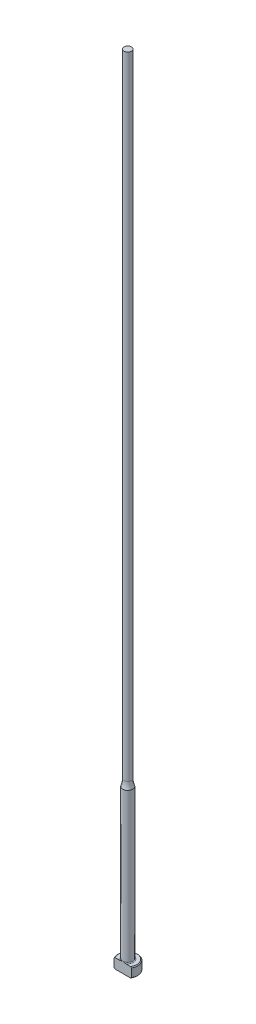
ISO-10303-21;
HEADER;
FILE_DESCRIPTION(('STEP AP214'),'2;1');
FILE_NAME('part.step','',(''),(''),'','','');
FILE_SCHEMA(('AUTOMOTIVE_DESIGN { 1 0 10303 214 1 1 1 1 }'));
ENDSEC;
DATA;
#1=APPLICATION_CONTEXT('core data for automotive mechanical design processes');
#2=APPLICATION_PROTOCOL_DEFINITION('international standard','automotive_design',2000,#1);
#3=PRODUCT_CONTEXT('',#1,'mechanical');
#4=PRODUCT('Part','Part','',(#3));
#5=PRODUCT_RELATED_PRODUCT_CATEGORY('part','',(#4));
#6=PRODUCT_DEFINITION_FORMATION('','',#4);
#7=PRODUCT_DEFINITION_CONTEXT('part definition',#1,'design');
#8=PRODUCT_DEFINITION('design','',#6,#7);
#9=PRODUCT_DEFINITION_SHAPE('','',#8);
#10=(LENGTH_UNIT() NAMED_UNIT(*) SI_UNIT(.MILLI.,.METRE.));
#11=(NAMED_UNIT(*) PLANE_ANGLE_UNIT() SI_UNIT($,.RADIAN.));
#12=(NAMED_UNIT(*) SI_UNIT($,.STERADIAN.) SOLID_ANGLE_UNIT());
#13=UNCERTAINTY_MEASURE_WITH_UNIT(LENGTH_MEASURE(1.E-05),#10,'distance_accuracy_value','');
#14=(GEOMETRIC_REPRESENTATION_CONTEXT(3) GLOBAL_UNCERTAINTY_ASSIGNED_CONTEXT((#13)) GLOBAL_UNIT_ASSIGNED_CONTEXT((#10,
#11,#12)) REPRESENTATION_CONTEXT('',''));
#15=CARTESIAN_POINT('',(0.,0.,0.));
#16=DIRECTION('',(0.,0.,1.));
#17=DIRECTION('',(1.,0.,0.));
#18=AXIS2_PLACEMENT_3D('',#15,#16,#17);
#19=CARTESIAN_POINT('',(-1.18998999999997,254.,0.));
#20=DIRECTION('',(0.,1.,0.));
#21=DIRECTION('',(0.,0.,1.));
#22=AXIS2_PLACEMENT_3D('',#19,#20,#21);
#23=PLANE('',#22);
#24=CARTESIAN_POINT('',(0.,254.,0.));
#25=DIRECTION('',(0.,1.,0.));
#26=DIRECTION('',(0.,0.,1.));
#27=AXIS2_PLACEMENT_3D('',#24,#25,#26);
#28=CIRCLE('',#27,1.18998999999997);
#29=CARTESIAN_POINT('',(0.,254.,1.18998999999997));
#30=VERTEX_POINT('',#29);
#31=EDGE_CURVE('E169',#30,#30,#28,.T.);
#32=ORIENTED_EDGE('',*,*,#31,.T.);
#33=EDGE_LOOP('',(#32));
#34=FACE_BOUND('',#33,.T.);
#35=ADVANCED_FACE('F37',(#34),#23,.T.);
#36=CARTESIAN_POINT('',(0.,259.958771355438,0.));
#37=DIRECTION('',(0.,1.,0.));
#38=DIRECTION('',(0.,0.,1.));
#39=AXIS2_PLACEMENT_3D('',#36,#37,#38);
#40=CYLINDRICAL_SURFACE('',#39,1.18998999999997);
#41=CARTESIAN_POINT('',(0.,53.0114164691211,0.));
#42=DIRECTION('',(0.,1.,0.));
#43=DIRECTION('',(0.,0.,1.));
#44=AXIS2_PLACEMENT_3D('',#41,#42,#43);
#45=CIRCLE('',#44,1.18998999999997);
#46=CARTESIAN_POINT('',(0.,53.0114164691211,1.18998999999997));
#47=VERTEX_POINT('',#46);
#48=EDGE_CURVE('E172',#47,#47,#45,.T.);
#49=ORIENTED_EDGE('',*,*,#48,.T.);
#50=EDGE_LOOP('',(#49));
#51=FACE_BOUND('',#50,.T.);
#52=ORIENTED_EDGE('',*,*,#31,.F.);
#53=EDGE_LOOP('',(#52));
#54=FACE_BOUND('',#53,.T.);
#55=ADVANCED_FACE('F160',(#51,#54),#40,.T.);
#56=CARTESIAN_POINT('',(0.,53.0114164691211,0.));
#57=DIRECTION('',(0.,1.,0.));
#58=DIRECTION('',(0.,0.,1.));
#59=AXIS2_PLACEMENT_3D('',#56,#57,#58);
#60=TOROIDAL_SURFACE('',#59,7.53998999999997,6.35);
#61=CARTESIAN_POINT('',(0.,50.8,0.));
#62=DIRECTION('',(0.,1.,0.));
#63=DIRECTION('',(0.,0.,1.));
#64=AXIS2_PLACEMENT_3D('',#61,#62,#63);
#65=CIRCLE('',#64,1.58749999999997);
#66=CARTESIAN_POINT('',(0.,50.8,1.58749999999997));
#67=VERTEX_POINT('',#66);
#68=EDGE_CURVE('E100',#67,#67,#65,.T.);
#69=ORIENTED_EDGE('',*,*,#68,.T.);
#70=EDGE_LOOP('',(#69));
#71=FACE_BOUND('',#70,.T.);
#72=ORIENTED_EDGE('',*,*,#48,.F.);
#73=EDGE_LOOP('',(#72));
#74=FACE_BOUND('',#73,.T.);
#75=ADVANCED_FACE('F165',(#71,#74),#60,.F.);
#76=CARTESIAN_POINT('',(0.,259.958771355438,0.));
#77=DIRECTION('',(0.,1.,0.));
#78=DIRECTION('',(0.,0.,1.));
#79=AXIS2_PLACEMENT_3D('',#76,#77,#78);
#80=CYLINDRICAL_SURFACE('',#79,1.58749999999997);
#81=CARTESIAN_POINT('',(0.,3.42900000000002,0.));
#82=DIRECTION('',(0.,1.,0.));
#83=DIRECTION('',(0.,0.,1.));
#84=AXIS2_PLACEMENT_3D('',#81,#82,#83);
#85=CIRCLE('',#84,1.58749999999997);
#86=CARTESIAN_POINT('',(0.,3.42900000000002,1.58749999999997));
#87=VERTEX_POINT('',#86);
#88=EDGE_CURVE('E109',#87,#87,#85,.T.);
#89=ORIENTED_EDGE('',*,*,#88,.T.);
#90=EDGE_LOOP('',(#89));
#91=FACE_BOUND('',#90,.T.);
#92=ORIENTED_EDGE('',*,*,#68,.F.);
#93=EDGE_LOOP('',(#92));
#94=FACE_BOUND('',#93,.T.);
#95=ADVANCED_FACE('F192',(#91,#94),#80,.T.);
#96=CARTESIAN_POINT('',(-3.17499999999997,3.175,0.));
#97=DIRECTION('',(0.,1.,0.));
#98=DIRECTION('',(0.,0.,1.));
#99=AXIS2_PLACEMENT_3D('',#96,#97,#98);
#100=PLANE('',#99);
#101=DIRECTION('',(-1.,0.,0.));
#102=VECTOR('',#101,1.);
#103=CARTESIAN_POINT('',(-3.17499999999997,3.175,1.58749999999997));
#104=LINE('',#103,#102);
#105=CARTESIAN_POINT('',(2.45195529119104,3.175,1.58749999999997));
#106=VERTEX_POINT('',#105);
#107=CARTESIAN_POINT('',(0.933255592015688,3.175,1.58749999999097));
#108=VERTEX_POINT('',#107);
#109=EDGE_CURVE('E58',#106,#108,#104,.T.);
#110=ORIENTED_EDGE('',*,*,#109,.F.);
#111=CARTESIAN_POINT('',(0.,3.175,0.));
#112=DIRECTION('',(0.,1.,0.));
#113=DIRECTION('',(0.,0.,1.));
#114=AXIS2_PLACEMENT_3D('',#111,#112,#113);
#115=CIRCLE('',#114,2.92099999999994);
#116=CARTESIAN_POINT('',(-2.45195529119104,3.175,1.58749999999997));
#117=VERTEX_POINT('',#116);
#118=EDGE_CURVE('E171',#106,#117,#115,.T.);
#119=ORIENTED_EDGE('',*,*,#118,.T.);
#120=CARTESIAN_POINT('',(-0.933255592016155,3.17500000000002,1.58749999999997));
#121=VERTEX_POINT('',#120);
#122=EDGE_CURVE('E140',#121,#117,#104,.T.);
#123=ORIENTED_EDGE('',*,*,#122,.F.);
#124=CARTESIAN_POINT('',(0.,3.175,0.));
#125=DIRECTION('',(0.,1.,0.));
#126=DIRECTION('',(0.,0.,1.));
#127=AXIS2_PLACEMENT_3D('',#124,#125,#126);
#128=CIRCLE('',#127,1.84149999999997);
#129=EDGE_CURVE('E113',#121,#108,#128,.F.);
#130=ORIENTED_EDGE('',*,*,#129,.T.);
#131=EDGE_LOOP('',(#110,#119,#123,#130));
#132=FACE_BOUND('',#131,.T.);
#133=ADVANCED_FACE('F189',(#132),#100,.T.);
#134=CARTESIAN_POINT('',(0.,259.958771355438,0.));
#135=DIRECTION('',(0.,1.,0.));
#136=DIRECTION('',(0.,0.,1.));
#137=AXIS2_PLACEMENT_3D('',#134,#135,#136);
#138=CYLINDRICAL_SURFACE('',#137,3.17499999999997);
#139=DIRECTION('',(0.,-1.,0.));
#140=VECTOR('',#139,1.);
#141=CARTESIAN_POINT('',(-2.74963065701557,254.,1.58749999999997));
#142=LINE('',#141,#140);
#143=CARTESIAN_POINT('',(-2.74963065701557,2.92100000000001,1.58749999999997));
#144=VERTEX_POINT('',#143);
#145=CARTESIAN_POINT('',(-2.74963065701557,0.253999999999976,1.58749999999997));
#146=VERTEX_POINT('',#145);
#147=EDGE_CURVE('E95',#144,#146,#142,.T.);
#148=ORIENTED_EDGE('',*,*,#147,.F.);
#149=CARTESIAN_POINT('',(0.,2.92100000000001,0.));
#150=DIRECTION('',(0.,1.,0.));
#151=DIRECTION('',(0.,0.,1.));
#152=AXIS2_PLACEMENT_3D('',#149,#150,#151);
#153=CIRCLE('',#152,3.17499999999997);
#154=CARTESIAN_POINT('',(2.74963065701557,2.92100000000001,1.58749999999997));
#155=VERTEX_POINT('',#154);
#156=EDGE_CURVE('E110',#144,#155,#153,.F.);
#157=ORIENTED_EDGE('',*,*,#156,.T.);
#158=DIRECTION('',(0.,-1.,0.));
#159=VECTOR('',#158,1.);
#160=CARTESIAN_POINT('',(2.74963065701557,254.,1.58749999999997));
#161=LINE('',#160,#159);
#162=CARTESIAN_POINT('',(2.74963065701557,0.253999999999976,1.58749999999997));
#163=VERTEX_POINT('',#162);
#164=EDGE_CURVE('E182',#155,#163,#161,.T.);
#165=ORIENTED_EDGE('',*,*,#164,.T.);
#166=CARTESIAN_POINT('',(0.,0.253999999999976,0.));
#167=DIRECTION('',(0.,-1.,0.));
#168=DIRECTION('',(0.,0.,-1.));
#169=AXIS2_PLACEMENT_3D('',#166,#167,#168);
#170=CIRCLE('',#169,3.17499999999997);
#171=EDGE_CURVE('E116',#163,#146,#170,.F.);
#172=ORIENTED_EDGE('',*,*,#171,.T.);
#173=EDGE_LOOP('',(#148,#157,#165,#172));
#174=FACE_BOUND('',#173,.T.);
#175=ADVANCED_FACE('F180',(#174),#138,.T.);
#176=CARTESIAN_POINT('',(0.,0.,0.));
#177=DIRECTION('',(0.,-1.,0.));
#178=DIRECTION('',(0.,0.,-1.));
#179=AXIS2_PLACEMENT_3D('',#176,#177,#178);
#180=PLANE('',#179);
#181=DIRECTION('',(1.,0.,0.));
#182=VECTOR('',#181,1.);
#183=CARTESIAN_POINT('',(-2.74963065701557,0.,1.58749999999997));
#184=LINE('',#183,#182);
#185=CARTESIAN_POINT('',(-2.45195529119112,0.,1.58749999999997));
#186=VERTEX_POINT('',#185);
#187=CARTESIAN_POINT('',(2.45195529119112,0.,1.58749999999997));
#188=VERTEX_POINT('',#187);
#189=EDGE_CURVE('E92',#186,#188,#184,.T.);
#190=ORIENTED_EDGE('',*,*,#189,.F.);
#191=CARTESIAN_POINT('',(0.,0.,0.));
#192=DIRECTION('',(0.,-1.,0.));
#193=DIRECTION('',(0.,0.,-1.));
#194=AXIS2_PLACEMENT_3D('',#191,#192,#193);
#195=CIRCLE('',#194,2.92100000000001);
#196=EDGE_CURVE('E106',#186,#188,#195,.T.);
#197=ORIENTED_EDGE('',*,*,#196,.T.);
#198=EDGE_LOOP('',(#190,#197));
#199=FACE_BOUND('',#198,.T.);
#200=ADVANCED_FACE('F105',(#199),#180,.T.);
#201=CARTESIAN_POINT('',(0.,3.17499999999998,0.));
#202=DIRECTION('',(0.,-1.,0.));
#203=DIRECTION('',(0.,0.,-1.));
#204=AXIS2_PLACEMENT_3D('',#201,#202,#203);
#205=CONICAL_SURFACE('',#204,2.92099999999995,0.785398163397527);
#206=CARTESIAN_POINT('',(2.75033065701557,2.9203937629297,1.58749999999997));
#207=CARTESIAN_POINT('',(2.66887796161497,2.99091042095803,1.58749999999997));
#208=CARTESIAN_POINT('',(2.58705989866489,3.0610138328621,1.58749999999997));
#209=CARTESIAN_POINT('',(2.42241022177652,3.20009957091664,1.58749999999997));
#210=CARTESIAN_POINT('',(2.33957813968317,3.26908134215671,1.58749999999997));
#211=CARTESIAN_POINT('',(2.17073968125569,3.40716024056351,1.58749999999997));
#212=CARTESIAN_POINT('',(2.08470440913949,3.47622217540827,1.58749999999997));
#213=CARTESIAN_POINT('',(1.91099881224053,3.61222325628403,1.58749999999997));
#214=CARTESIAN_POINT('',(1.82332890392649,3.67916293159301,1.58749999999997));
#215=CARTESIAN_POINT('',(1.64569223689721,3.8102066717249,1.58749999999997));
#216=CARTESIAN_POINT('',(1.55572245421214,3.8743066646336,1.58749999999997));
#217=CARTESIAN_POINT('',(1.37280394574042,3.99833089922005,1.58749999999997));
#218=CARTESIAN_POINT('',(1.27985285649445,4.05825170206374,1.58749999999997));
#219=CARTESIAN_POINT('',(1.09086561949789,4.17130826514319,1.58749999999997));
#220=CARTESIAN_POINT('',(0.994859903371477,4.22449421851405,1.58749999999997));
#221=CARTESIAN_POINT('',(0.798114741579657,4.32122233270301,1.58749999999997));
#222=CARTESIAN_POINT('',(0.697384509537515,4.36478238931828,1.58749999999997));
#223=CARTESIAN_POINT('',(0.541185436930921,4.41951656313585,1.58749999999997));
#224=CARTESIAN_POINT('',(0.487627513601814,4.43611950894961,1.58749999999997));
#225=CARTESIAN_POINT('',(0.379267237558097,4.46466012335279,1.58749999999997));
#226=CARTESIAN_POINT('',(0.324465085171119,4.4765985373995,1.58749999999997));
#227=CARTESIAN_POINT('',(0.214272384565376,4.49501904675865,1.58749999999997));
#228=CARTESIAN_POINT('',(0.158887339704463,4.50153345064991,1.58749999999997));
#229=CARTESIAN_POINT('',(0.047736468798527,4.5087502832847,1.58749999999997));
#230=CARTESIAN_POINT('',(-0.00802931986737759,4.50945327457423,1.58749999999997));
#231=CARTESIAN_POINT('',(-0.119372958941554,4.50499163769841,1.58749999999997));
#232=CARTESIAN_POINT('',(-0.174950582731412,4.49982147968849,1.58749999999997));
#233=CARTESIAN_POINT('',(-0.285312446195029,4.48399101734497,1.58749999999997));
#234=CARTESIAN_POINT('',(-0.340096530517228,4.4733296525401,1.58749999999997));
#235=CARTESIAN_POINT('',(-0.448865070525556,4.44711334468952,1.58749999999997));
#236=CARTESIAN_POINT('',(-0.502841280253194,4.43152477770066,1.58749999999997));
#237=CARTESIAN_POINT('',(-0.609429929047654,4.39628553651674,1.58749999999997));
#238=CARTESIAN_POINT('',(-0.662042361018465,4.37663484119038,1.58749999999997));
#239=CARTESIAN_POINT('',(-0.778129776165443,4.32902110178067,1.58749999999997));
#240=CARTESIAN_POINT('',(-0.841245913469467,4.30019026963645,1.58749999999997));
#241=CARTESIAN_POINT('',(-0.96559457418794,4.23868811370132,1.58749999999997));
#242=CARTESIAN_POINT('',(-1.02682597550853,4.20601455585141,1.58749999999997));
#243=CARTESIAN_POINT('',(-1.14774341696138,4.13769010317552,1.58749999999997));
#244=CARTESIAN_POINT('',(-1.20742632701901,4.10203371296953,1.58749999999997));
#245=CARTESIAN_POINT('',(-1.32539130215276,4.02846531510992,1.58749999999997));
#246=CARTESIAN_POINT('',(-1.38367308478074,3.99055285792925,1.58749999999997));
#247=CARTESIAN_POINT('',(-1.55734442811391,3.87382704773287,1.58749999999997));
#248=CARTESIAN_POINT('',(-1.6709584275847,3.79237897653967,1.58749999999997));
#249=CARTESIAN_POINT('',(-1.89475235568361,3.62521862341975,1.58749999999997));
#250=CARTESIAN_POINT('',(-2.00493591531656,3.53951111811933,1.58749999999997));
#251=CARTESIAN_POINT('',(-2.22248693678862,3.36554942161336,1.58749999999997));
#252=CARTESIAN_POINT('',(-2.32986450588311,3.27730782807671,1.58749999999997));
#253=CARTESIAN_POINT('',(-2.48909538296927,3.14389342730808,1.58749999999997));
#254=CARTESIAN_POINT('',(-2.54159338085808,3.09948435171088,1.58749999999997));
#255=CARTESIAN_POINT('',(-2.64622282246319,3.01024124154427,1.58749999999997));
#256=CARTESIAN_POINT('',(-2.69835428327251,2.96540722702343,1.58749999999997));
#257=CARTESIAN_POINT('',(-2.75033065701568,2.92039376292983,1.58749999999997));
#258=B_SPLINE_CURVE_WITH_KNOTS('',3,(#206,#207,#208,#209,#210,#211,#212,#213,#214,#215,#216,
#217,#218,#219,#220,#221,#222,#223,#224,#225,#226,#227,#228,#229,#230,#231,#232,#233,#234,#235,
#236,#237,#238,#239,#240,#241,#242,#243,#244,#245,#246,#247,#248,#249,#250,#251,#252,#253,#254,
#255,#256,#257),.UNSPECIFIED.,.F.,.F.,(4,2,2,2,2,2,2,2,2,2,2,2,2,2,2,2,2,2,2,2,2,2,2,2,2,4),(0.,
0.323216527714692,0.64658837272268,0.97753957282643,1.30840757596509,1.639735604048,
1.97133312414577,2.30029221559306,2.62863448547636,2.79668277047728,2.96470418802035,
3.13171746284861,3.29871457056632,3.46586904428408,3.63305581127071,3.80140905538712,
3.96976317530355,4.17775353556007,4.38586541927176,4.59436953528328,4.80291533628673,
5.22209642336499,5.64081759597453,6.0577303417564,6.26401477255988,6.47028951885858),.UNSPECIFIED.);
#259=EDGE_CURVE('E63',#155,#106,#258,.T.);
#260=ORIENTED_EDGE('',*,*,#259,.F.);
#261=ORIENTED_EDGE('',*,*,#156,.F.);
#262=EDGE_CURVE('E133',#117,#144,#258,.T.);
#263=ORIENTED_EDGE('',*,*,#262,.F.);
#264=ORIENTED_EDGE('',*,*,#118,.F.);
#265=EDGE_LOOP('',(#260,#261,#263,#264));
#266=FACE_BOUND('',#265,.T.);
#267=ADVANCED_FACE('F147',(#266),#205,.T.);
#268=CARTESIAN_POINT('',(0.,0.253999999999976,0.));
#269=DIRECTION('',(0.,1.,0.));
#270=DIRECTION('',(0.,0.,1.));
#271=AXIS2_PLACEMENT_3D('',#268,#269,#270);
#272=CONICAL_SURFACE('',#271,3.17499999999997,0.785398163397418);
#273=CARTESIAN_POINT('',(-2.75033065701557,0.254606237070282,1.58749999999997));
#274=CARTESIAN_POINT('',(-2.66887796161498,0.184089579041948,1.58749999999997));
#275=CARTESIAN_POINT('',(-2.58705989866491,0.113986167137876,1.58749999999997));
#276=CARTESIAN_POINT('',(-2.42241022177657,-0.0250995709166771,1.58749999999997));
#277=CARTESIAN_POINT('',(-2.33957813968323,-0.0940813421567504,1.58749999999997));
#278=CARTESIAN_POINT('',(-2.17073968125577,-0.232160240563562,1.58749999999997));
#279=CARTESIAN_POINT('',(-2.08470440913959,-0.301222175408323,1.58749999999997));
#280=CARTESIAN_POINT('',(-1.91099881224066,-0.437223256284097,1.58749999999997));
#281=CARTESIAN_POINT('',(-1.82332890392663,-0.50416293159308,1.58749999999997));
#282=CARTESIAN_POINT('',(-1.64569223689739,-0.635206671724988,1.58749999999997));
#283=CARTESIAN_POINT('',(-1.55572245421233,-0.699306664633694,1.58749999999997));
#284=CARTESIAN_POINT('',(-1.37280394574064,-0.823330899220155,1.58749999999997));
#285=CARTESIAN_POINT('',(-1.27985285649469,-0.883251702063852,1.58749999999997));
#286=CARTESIAN_POINT('',(-1.09086561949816,-0.996308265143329,1.58749999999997));
#287=CARTESIAN_POINT('',(-0.994859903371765,-1.0494942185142,1.58749999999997));
#288=CARTESIAN_POINT('',(-0.798114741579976,-1.14622233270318,1.58749999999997));
#289=CARTESIAN_POINT('',(-0.697384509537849,-1.18978238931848,1.58749999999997));
#290=CARTESIAN_POINT('',(-0.54118543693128,-1.24451656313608,1.58749999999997));
#291=CARTESIAN_POINT('',(-0.487627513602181,-1.26111950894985,1.58749999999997));
#292=CARTESIAN_POINT('',(-0.379267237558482,-1.28966012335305,1.58749999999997));
#293=CARTESIAN_POINT('',(-0.324465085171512,-1.30159853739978,1.58749999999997));
#294=CARTESIAN_POINT('',(-0.214272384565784,-1.32001904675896,1.58749999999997));
#295=CARTESIAN_POINT('',(-0.158887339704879,-1.32653345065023,1.58749999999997));
#296=CARTESIAN_POINT('',(-0.0477364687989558,-1.33375028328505,1.58749999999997));
#297=CARTESIAN_POINT('',(0.00802931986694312,-1.33445327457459,1.58749999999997));
#298=CARTESIAN_POINT('',(0.119372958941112,-1.32999163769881,1.58749999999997));
#299=CARTESIAN_POINT('',(0.174950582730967,-1.3248214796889,1.58749999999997));
#300=CARTESIAN_POINT('',(0.28531244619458,-1.30899101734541,1.58749999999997));
#301=CARTESIAN_POINT('',(0.340096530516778,-1.29832965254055,1.58749999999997));
#302=CARTESIAN_POINT('',(0.448865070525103,-1.27211334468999,1.58749999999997));
#303=CARTESIAN_POINT('',(0.50284128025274,-1.25652477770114,1.58749999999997));
#304=CARTESIAN_POINT('',(0.609429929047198,-1.22128553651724,1.58749999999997));
#305=CARTESIAN_POINT('',(0.662042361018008,-1.20163484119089,1.58749999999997));
#306=CARTESIAN_POINT('',(0.778129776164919,-1.15402110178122,1.58749999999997));
#307=CARTESIAN_POINT('',(0.841245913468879,-1.12519026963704,1.58749999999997));
#308=CARTESIAN_POINT('',(0.965594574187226,-1.06368811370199,1.58749999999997));
#309=CARTESIAN_POINT('',(1.02682597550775,-1.03101455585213,1.58749999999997));
#310=CARTESIAN_POINT('',(1.14774341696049,-0.962690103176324,1.58749999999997));
#311=CARTESIAN_POINT('',(1.20742632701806,-0.927033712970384,1.58749999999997));
#312=CARTESIAN_POINT('',(1.32539130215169,-0.85346531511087,1.58749999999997));
#313=CARTESIAN_POINT('',(1.38367308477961,-0.815552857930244,1.58749999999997));
#314=CARTESIAN_POINT('',(1.5573444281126,-0.698827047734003,1.58749999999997));
#315=CARTESIAN_POINT('',(1.67095842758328,-0.617378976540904,1.58749999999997));
#316=CARTESIAN_POINT('',(1.89475235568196,-0.45021862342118,1.58749999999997));
#317=CARTESIAN_POINT('',(2.0049359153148,-0.364511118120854,1.58749999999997));
#318=CARTESIAN_POINT('',(2.22248693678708,-0.19054942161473,1.58749999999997));
#319=CARTESIAN_POINT('',(2.3298645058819,-0.102307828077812,1.58749999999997));
#320=CARTESIAN_POINT('',(2.48909538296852,0.0311065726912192,1.58749999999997));
#321=CARTESIAN_POINT('',(2.54159338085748,0.0755156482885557,1.58749999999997));
#322=CARTESIAN_POINT('',(2.64622282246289,0.16475875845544,1.58749999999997));
#323=CARTESIAN_POINT('',(2.69835428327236,0.209592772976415,1.58749999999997));
#324=CARTESIAN_POINT('',(2.75033065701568,0.254606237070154,1.58749999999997));
#325=B_SPLINE_CURVE_WITH_KNOTS('',3,(#273,#274,#275,#276,#277,#278,#279,#280,#281,#282,#283,
#284,#285,#286,#287,#288,#289,#290,#291,#292,#293,#294,#295,#296,#297,#298,#299,#300,#301,#302,
#303,#304,#305,#306,#307,#308,#309,#310,#311,#312,#313,#314,#315,#316,#317,#318,#319,#320,#321,
#322,#323,#324),.UNSPECIFIED.,.F.,.F.,(4,2,2,2,2,2,2,2,2,2,2,2,2,2,2,2,2,2,2,2,2,2,2,2,2,4),(0.,
0.323216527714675,0.646588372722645,0.977539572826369,1.308407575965,1.63973560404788,
1.97133312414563,2.3002922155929,2.62863448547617,2.79668277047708,2.96470418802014,
3.13171746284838,3.29871457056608,3.46586904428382,3.63305581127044,3.80140905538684,
3.96976317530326,4.17775353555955,4.38586541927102,4.59436953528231,4.80291533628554,
5.22209642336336,5.64081759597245,6.05773034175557,6.26401477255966,6.47028951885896),.UNSPECIFIED.);
#326=EDGE_CURVE('E89',#146,#186,#325,.T.);
#327=ORIENTED_EDGE('',*,*,#326,.F.);
#328=ORIENTED_EDGE('',*,*,#171,.F.);
#329=EDGE_CURVE('E101',#188,#163,#325,.T.);
#330=ORIENTED_EDGE('',*,*,#329,.F.);
#331=ORIENTED_EDGE('',*,*,#196,.F.);
#332=EDGE_LOOP('',(#327,#328,#330,#331));
#333=FACE_BOUND('',#332,.T.);
#334=ADVANCED_FACE('F108',(#333),#272,.T.);
#335=CARTESIAN_POINT('',(0.,3.42900000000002,0.));
#336=DIRECTION('',(0.,1.,0.));
#337=DIRECTION('',(0.,0.,1.));
#338=AXIS2_PLACEMENT_3D('',#335,#336,#337);
#339=TOROIDAL_SURFACE('',#338,1.84149999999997,0.254);
#340=ORIENTED_EDGE('',*,*,#129,.F.);
#341=CARTESIAN_POINT('',(0.,3.42900000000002,1.58749999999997));
#342=CARTESIAN_POINT('',(-1.92205025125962E-10,3.42900057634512,1.58749999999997));
#343=CARTESIAN_POINT('',(-1.22611614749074E-07,3.42900115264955,1.58749999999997));
#344=CARTESIAN_POINT('',(-5.0967636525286E-07,3.42900226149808,1.58749999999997));
#345=CARTESIAN_POINT('',(-7.78176328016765E-07,3.42900279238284,1.58749999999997));
#346=CARTESIAN_POINT('',(-1.42307272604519E-06,3.42900385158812,1.58749999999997));
#347=CARTESIAN_POINT('',(-1.80713867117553E-06,3.42900437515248,1.58749999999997));
#348=CARTESIAN_POINT('',(-2.63494846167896E-06,3.4290053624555,1.58749999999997));
#349=CARTESIAN_POINT('',(-3.07814756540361E-06,3.42900582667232,1.58749999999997));
#350=CARTESIAN_POINT('',(-4.66897357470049E-06,3.4290073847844,1.58749999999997));
#351=CARTESIAN_POINT('',(-5.89404908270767E-06,3.42900840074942,1.58749999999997));
#352=CARTESIAN_POINT('',(-8.42427511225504E-06,3.42901020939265,1.58749999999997));
#353=CARTESIAN_POINT('',(-9.72480574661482E-06,3.42901100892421,1.58749999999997));
#354=CARTESIAN_POINT('',(-1.48060601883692E-05,3.42901401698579,1.58749999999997));
#355=CARTESIAN_POINT('',(-1.86838281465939E-05,3.42901606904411,1.58749999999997));
#356=CARTESIAN_POINT('',(-2.63261117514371E-05,3.42901942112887,1.58749999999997));
#357=CARTESIAN_POINT('',(-3.00687417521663E-05,3.42902077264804,1.58749999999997));
#358=CARTESIAN_POINT('',(-4.60276298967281E-05,3.42902652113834,1.58749999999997));
#359=CARTESIAN_POINT('',(-5.8247019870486E-05,3.4290308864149,1.58749999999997));
#360=CARTESIAN_POINT('',(-8.11070097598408E-05,3.42903788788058,1.58749999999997));
#361=CARTESIAN_POINT('',(-9.16953114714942E-05,3.42904068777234,1.58749999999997));
#362=CARTESIAN_POINT('',(-0.000168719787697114,3.4290628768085,1.58749999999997));
#363=CARTESIAN_POINT('',(-0.00023219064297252,3.42909118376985,1.58749999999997));
#364=CARTESIAN_POINT('',(-0.000479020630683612,3.42919723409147,1.58749999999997));
#365=CARTESIAN_POINT('',(-0.000664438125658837,3.42926834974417,1.58749999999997));
#366=CARTESIAN_POINT('',(-0.00138448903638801,3.42954862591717,1.58749999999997));
#367=CARTESIAN_POINT('',(-0.00191701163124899,3.42976473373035,1.58749999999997));
#368=CARTESIAN_POINT('',(-0.00409774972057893,3.43064550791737,1.58749999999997));
#369=CARTESIAN_POINT('',(-0.00574830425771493,3.43130231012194,1.58749999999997));
#370=CARTESIAN_POINT('',(-0.0289985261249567,3.44055947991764,1.58749999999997));
#371=CARTESIAN_POINT('',(-0.0505816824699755,3.44921674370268,1.58749999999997));
#372=CARTESIAN_POINT('',(-0.0929947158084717,3.46610702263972,1.58749999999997));
#373=CARTESIAN_POINT('',(-0.11382315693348,3.47434394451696,1.58749999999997));
#374=CARTESIAN_POINT('',(-0.1579563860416,3.49164606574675,1.58749999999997));
#375=CARTESIAN_POINT('',(-0.181267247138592,3.5006960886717,1.58749999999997));
#376=CARTESIAN_POINT('',(-0.228222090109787,3.51863224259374,1.58749999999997));
#377=CARTESIAN_POINT('',(-0.251867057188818,3.52751579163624,1.58749999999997));
#378=CARTESIAN_POINT('',(-0.310512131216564,3.54905503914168,1.58749999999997));
#379=CARTESIAN_POINT('',(-0.345588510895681,3.56150550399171,1.58749999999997));
#380=CARTESIAN_POINT('',(-0.415278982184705,3.5850302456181,1.58749999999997));
#381=CARTESIAN_POINT('',(-0.449884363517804,3.59613012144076,1.58749999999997));
#382=CARTESIAN_POINT('',(-0.524471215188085,3.61841679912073,1.58749999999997));
#383=CARTESIAN_POINT('',(-0.564517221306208,3.62939137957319,1.58749999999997));
#384=CARTESIAN_POINT('',(-0.645529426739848,3.6489746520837,1.58749999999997));
#385=CARTESIAN_POINT('',(-0.686500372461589,3.65756417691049,1.58749999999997));
#386=CARTESIAN_POINT('',(-0.771546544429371,3.67188287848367,1.58749999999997));
#387=CARTESIAN_POINT('',(-0.815658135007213,3.67740449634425,1.58749999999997));
#388=CARTESIAN_POINT('',(-0.904117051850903,3.68344603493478,1.58749999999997));
#389=CARTESIAN_POINT('',(-0.948462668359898,3.68398638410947,1.58749999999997));
#390=CARTESIAN_POINT('',(-1.02531896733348,3.67901051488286,1.58749999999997));
#391=CARTESIAN_POINT('',(-1.05792141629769,3.67502604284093,1.58749999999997));
#392=CARTESIAN_POINT('',(-1.12184393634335,3.66230832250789,1.58749999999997));
#393=CARTESIAN_POINT('',(-1.1531753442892,3.65363950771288,1.58749999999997));
#394=CARTESIAN_POINT('',(-1.19946468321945,3.6356384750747,1.58749999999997));
#395=CARTESIAN_POINT('',(-1.21526783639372,3.62848492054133,1.58749999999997));
#396=CARTESIAN_POINT('',(-1.24583726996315,3.61212937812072,1.58749999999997));
#397=CARTESIAN_POINT('',(-1.26060215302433,3.60292469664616,1.58749999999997));
#398=CARTESIAN_POINT('',(-1.28575815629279,3.58421518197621,1.58749999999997));
#399=CARTESIAN_POINT('',(-1.29644383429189,3.57510998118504,1.58749999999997));
#400=CARTESIAN_POINT('',(-1.31623154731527,3.55531539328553,1.58749999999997));
#401=CARTESIAN_POINT('',(-1.32533681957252,3.54462932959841,1.58749999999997));
#402=CARTESIAN_POINT('',(-1.33941140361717,3.52450022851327,1.58749999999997));
#403=CARTESIAN_POINT('',(-1.34484814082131,3.51538553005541,1.58749999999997));
#404=CARTESIAN_POINT('',(-1.35416329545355,3.49638544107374,1.58749999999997));
#405=CARTESIAN_POINT('',(-1.35804267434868,3.48650053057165,1.58749999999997));
#406=CARTESIAN_POINT('',(-1.36398436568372,3.46611321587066,1.58749999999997));
#407=CARTESIAN_POINT('',(-1.36603350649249,3.45560690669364,1.58749999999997));
#408=CARTESIAN_POINT('',(-1.3680840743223,3.43439627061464,1.58749999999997));
#409=CARTESIAN_POINT('',(-1.36808648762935,3.42369204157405,1.58749999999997));
#410=CARTESIAN_POINT('',(-1.36616208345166,3.40366716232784,1.58749999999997));
#411=CARTESIAN_POINT('',(-1.36444960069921,3.39432493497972,1.58749999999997));
#412=CARTESIAN_POINT('',(-1.35953338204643,3.37604480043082,1.58749999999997));
#413=CARTESIAN_POINT('',(-1.3563294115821,3.36710695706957,1.58749999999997));
#414=CARTESIAN_POINT('',(-1.34848006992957,3.34949697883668,1.58749999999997));
#415=CARTESIAN_POINT('',(-1.34378578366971,3.34084688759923,1.58749999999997));
#416=CARTESIAN_POINT('',(-1.33324445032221,3.32428742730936,1.58749999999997));
#417=CARTESIAN_POINT('',(-1.32739692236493,3.31637836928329,1.58749999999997));
#418=CARTESIAN_POINT('',(-1.31107304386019,3.29692878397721,1.58749999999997));
#419=CARTESIAN_POINT('',(-1.29989286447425,3.28597778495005,1.58749999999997));
#420=CARTESIAN_POINT('',(-1.27593566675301,3.26597490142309,1.58749999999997));
#421=CARTESIAN_POINT('',(-1.26315370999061,3.25692913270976,1.58749999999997));
#422=CARTESIAN_POINT('',(-1.22930733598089,3.23613976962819,1.58749999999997));
#423=CARTESIAN_POINT('',(-1.20751096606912,3.22559415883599,1.58749999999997));
#424=CARTESIAN_POINT('',(-1.16266144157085,3.20795356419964,1.58749999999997));
#425=CARTESIAN_POINT('',(-1.13960937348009,3.20085564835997,1.58749999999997));
#426=CARTESIAN_POINT('',(-1.07603916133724,3.18534571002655,1.58749999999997));
#427=CARTESIAN_POINT('',(-1.03486686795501,3.17965078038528,1.58749999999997));
#428=CARTESIAN_POINT('',(-0.95155815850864,3.1741711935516,1.58749999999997));
#429=CARTESIAN_POINT('',(-0.909417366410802,3.17449023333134,1.58749999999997));
#430=CARTESIAN_POINT('',(-0.811383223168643,3.18054602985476,1.58749999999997));
#431=CARTESIAN_POINT('',(-0.755610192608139,3.18806126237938,1.58749999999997));
#432=CARTESIAN_POINT('',(-0.644937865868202,3.20866626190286,1.58749999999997));
#433=CARTESIAN_POINT('',(-0.59004364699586,3.22178102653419,1.58749999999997));
#434=CARTESIAN_POINT('',(-0.485757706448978,3.25059077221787,1.58749999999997));
#435=CARTESIAN_POINT('',(-0.436281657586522,3.26598903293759,1.58749999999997));
#436=CARTESIAN_POINT('',(-0.338551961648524,3.29877502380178,1.58749999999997));
#437=CARTESIAN_POINT('',(-0.290291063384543,3.31614156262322,1.58749999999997));
#438=CARTESIAN_POINT('',(-0.225557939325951,3.34039762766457,1.58749999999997));
#439=CARTESIAN_POINT('',(-0.208874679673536,3.346735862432,1.58749999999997));
#440=CARTESIAN_POINT('',(-0.175123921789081,3.35969957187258,1.58749999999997));
#441=CARTESIAN_POINT('',(-0.158057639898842,3.36632823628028,1.58749999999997));
#442=CARTESIAN_POINT('',(-0.117638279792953,3.38214476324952,1.58749999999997));
#443=CARTESIAN_POINT('',(-0.094300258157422,3.39137029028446,1.58749999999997));
#444=CARTESIAN_POINT('',(-0.0497824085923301,3.40910304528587,1.58749999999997));
#445=CARTESIAN_POINT('',(-0.0285986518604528,3.41759960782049,1.58749999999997));
#446=CARTESIAN_POINT('',(-0.00575168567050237,3.42669635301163,1.58749999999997));
#447=CARTESIAN_POINT('',(-0.00410451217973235,3.42735181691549,1.58749999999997));
#448=CARTESIAN_POINT('',(-0.0019245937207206,3.42823223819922,1.58749999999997));
#449=CARTESIAN_POINT('',(-0.00138952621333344,3.42844937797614,1.58749999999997));
#450=CARTESIAN_POINT('',(-0.00066624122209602,3.42873091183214,1.58749999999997));
#451=CARTESIAN_POINT('',(-0.000480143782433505,3.42880228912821,1.58749999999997));
#452=CARTESIAN_POINT('',(-0.000232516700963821,3.42890868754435,1.58749999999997));
#453=CARTESIAN_POINT('',(-0.000168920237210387,3.42893705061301,1.58749999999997));
#454=CARTESIAN_POINT('',(-9.1752716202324E-05,3.42895927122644,1.58749999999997));
#455=CARTESIAN_POINT('',(-8.11550293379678E-05,3.42896207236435,1.58749999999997));
#456=CARTESIAN_POINT('',(-5.82743948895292E-05,3.42896908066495,1.58749999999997));
#457=CARTESIAN_POINT('',(-4.60440001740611E-05,3.42897345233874,1.58749999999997));
#458=CARTESIAN_POINT('',(-3.00727682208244E-05,3.42897920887,1.58749999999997));
#459=CARTESIAN_POINT('',(-2.63286807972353E-05,3.4289805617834,1.58749999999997));
#460=CARTESIAN_POINT('',(-1.86836529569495E-05,3.42898391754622,1.58749999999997));
#461=CARTESIAN_POINT('',(-1.48046517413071E-05,3.42898597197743,1.58749999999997));
#462=CARTESIAN_POINT('',(-9.72223943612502E-06,3.42898898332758,1.58749999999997));
#463=CARTESIAN_POINT('',(-8.42159649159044E-06,3.42898978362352,1.58749999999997));
#464=CARTESIAN_POINT('',(-5.89129729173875E-06,3.42899159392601,1.58749999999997));
#465=CARTESIAN_POINT('',(-4.6662686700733E-06,3.42899261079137,1.58749999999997));
#466=CARTESIAN_POINT('',(-3.07568803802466E-06,3.42899417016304,1.58749999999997));
#467=CARTESIAN_POINT('',(-2.63259565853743E-06,3.42899463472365,1.58749999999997));
#468=CARTESIAN_POINT('',(-1.80506085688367E-06,3.42899562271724,1.58749999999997));
#469=CARTESIAN_POINT('',(-1.4211638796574E-06,3.42899614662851,1.58749999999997));
#470=CARTESIAN_POINT('',(-7.76675643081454E-07,3.42899720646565,1.58749999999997));
#471=CARTESIAN_POINT('',(-5.08406487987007E-07,3.42899773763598,1.58749999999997));
#472=CARTESIAN_POINT('',(-1.21901887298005E-07,3.42899884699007,1.58749999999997));
#473=CARTESIAN_POINT('',(1.922515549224E-10,3.42899942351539,1.58749999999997));
#474=CARTESIAN_POINT('',(0.,3.42900000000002,1.58749999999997));
#475=B_SPLINE_CURVE_WITH_KNOTS('',3,(#341,#342,#343,#344,#345,#346,#347,#348,#349,#350,#351,
#352,#353,#354,#355,#356,#357,#358,#359,#360,#361,#362,#363,#364,#365,#366,#367,#368,#369,#370,
#371,#372,#373,#374,#375,#376,#377,#378,#379,#380,#381,#382,#383,#384,#385,#386,#387,#388,#389,
#390,#391,#392,#393,#394,#395,#396,#397,#398,#399,#400,#401,#402,#403,#404,#405,#406,#407,#408,
#409,#410,#411,#412,#413,#414,#415,#416,#417,#418,#419,#420,#421,#422,#423,#424,#425,#426,#427,
#428,#429,#430,#431,#432,#433,#434,#435,#436,#437,#438,#439,#440,#441,#442,#443,#444,#445,#446,
#447,#448,#449,#450,#451,#452,#453,#454,#455,#456,#457,#458,#459,#460,#461,#462,#463,#464,#465,
#466,#467,#468,#469,#470,#471,#472,#473,#474),.UNSPECIFIED.,.T.,.F.,(4,2,2,2,2,2,2,2,2,2,2,2,2,
2,2,2,2,2,2,2,2,2,2,2,2,2,2,2,2,2,2,2,2,2,2,2,2,2,2,2,2,2,2,2,2,2,2,2,2,2,2,2,2,2,2,2,2,2,2,2,2,
2,2,2,2,2,4),(0.,1.72815458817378E-06,3.5042925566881E-06,5.44431004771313E-06,
7.36755250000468E-06,1.21190896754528E-05,1.66953775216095E-05,2.98160400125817E-05,
4.17409564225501E-05,8.0660475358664E-05,0.000113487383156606,0.000321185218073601,
0.000917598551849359,0.00264089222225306,0.00797105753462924,0.0777276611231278,
0.144923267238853,0.219939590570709,0.295714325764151,0.407362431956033,0.516367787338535,
0.64087844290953,0.766362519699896,0.899536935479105,1.03216495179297,1.13045740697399,
1.22743103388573,1.27935899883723,1.33135556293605,1.37333248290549,1.41522237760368,
1.44693946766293,1.47863694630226,1.51056074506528,1.54246916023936,1.57083210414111,
1.59919951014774,1.62861579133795,1.65804436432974,1.70472658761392,1.75155645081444,
1.82378709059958,1.89595619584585,2.01995471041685,2.1460932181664,2.31447224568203,
2.48361094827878,2.63898919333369,2.79283011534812,2.84637031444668,2.90129461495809,
2.97658236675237,3.04504771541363,3.05036697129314,3.05209849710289,3.05269709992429,
3.05290520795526,3.05293806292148,3.05297701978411,3.05298895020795,3.05300207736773,
3.05300665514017,3.0530114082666,3.05301333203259,3.05301527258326,3.05301704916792,
3.05301877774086),.UNSPECIFIED.);
#476=EDGE_CURVE('E11',#121,#87,#475,.T.);
#477=ORIENTED_EDGE('',*,*,#476,.T.);
#478=ORIENTED_EDGE('',*,*,#88,.F.);
#479=CARTESIAN_POINT('',(0.,3.42900000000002,1.58749999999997));
#480=CARTESIAN_POINT('',(1.92204979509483E-10,3.42899942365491,1.58749999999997));
#481=CARTESIAN_POINT('',(1.22611614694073E-07,3.42899884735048,1.58749999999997));
#482=CARTESIAN_POINT('',(5.09676365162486E-07,3.42899773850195,1.58749999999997));
#483=CARTESIAN_POINT('',(7.78176327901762E-07,3.42899720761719,1.58749999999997));
#484=CARTESIAN_POINT('',(1.42307272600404E-06,3.42899614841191,1.58749999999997));
#485=CARTESIAN_POINT('',(1.8071386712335E-06,3.42899562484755,1.58749999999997));
#486=CARTESIAN_POINT('',(2.63494846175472E-06,3.42899463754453,1.58749999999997));
#487=CARTESIAN_POINT('',(3.07814756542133E-06,3.42899417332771,1.58749999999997));
#488=CARTESIAN_POINT('',(4.66897357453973E-06,3.42899261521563,1.58749999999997));
#489=CARTESIAN_POINT('',(5.89404908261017E-06,3.42899159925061,1.58749999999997));
#490=CARTESIAN_POINT('',(8.4242751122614E-06,3.42898979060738,1.58749999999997));
#491=CARTESIAN_POINT('',(9.72480574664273E-06,3.42898899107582,1.58749999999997));
#492=CARTESIAN_POINT('',(1.48060601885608E-05,3.42898598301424,1.58749999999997));
#493=CARTESIAN_POINT('',(1.86838281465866E-05,3.42898393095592,1.58749999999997));
#494=CARTESIAN_POINT('',(2.63261117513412E-05,3.42898057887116,1.58749999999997));
#495=CARTESIAN_POINT('',(3.00687417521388E-05,3.42897922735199,1.58749999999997));
#496=CARTESIAN_POINT('',(4.60276298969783E-05,3.42897347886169,1.58749999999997));
#497=CARTESIAN_POINT('',(5.82470198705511E-05,3.42896911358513,1.58749999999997));
#498=CARTESIAN_POINT('',(8.11070097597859E-05,3.42896211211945,1.58749999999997));
#499=CARTESIAN_POINT('',(9.16953114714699E-05,3.42895931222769,1.58749999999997));
#500=CARTESIAN_POINT('',(0.000168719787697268,3.42893712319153,1.58749999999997));
#501=CARTESIAN_POINT('',(0.000232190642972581,3.42890881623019,1.58749999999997));
#502=CARTESIAN_POINT('',(0.000479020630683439,3.42880276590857,1.58749999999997));
#503=CARTESIAN_POINT('',(0.00066443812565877,3.42873165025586,1.58749999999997));
#504=CARTESIAN_POINT('',(0.0013844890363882,3.42845137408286,1.58749999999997));
#505=CARTESIAN_POINT('',(0.00191701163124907,3.42823526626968,1.58749999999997));
#506=CARTESIAN_POINT('',(0.00409774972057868,3.42735449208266,1.58749999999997));
#507=CARTESIAN_POINT('',(0.00574830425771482,3.42669768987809,1.58749999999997));
#508=CARTESIAN_POINT('',(0.0289985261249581,3.4174405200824,1.58749999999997));
#509=CARTESIAN_POINT('',(0.0505816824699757,3.40878325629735,1.58749999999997));
#510=CARTESIAN_POINT('',(0.0929947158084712,3.39189297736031,1.58749999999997));
#511=CARTESIAN_POINT('',(0.113823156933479,3.38365605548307,1.58749999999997));
#512=CARTESIAN_POINT('',(0.1579563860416,3.36635393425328,1.58749999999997));
#513=CARTESIAN_POINT('',(0.181267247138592,3.35730391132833,1.58749999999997));
#514=CARTESIAN_POINT('',(0.228222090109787,3.33936775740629,1.58749999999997));
#515=CARTESIAN_POINT('',(0.251867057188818,3.33048420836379,1.58749999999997));
#516=CARTESIAN_POINT('',(0.310512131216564,3.30894496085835,1.58749999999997));
#517=CARTESIAN_POINT('',(0.345588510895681,3.29649449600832,1.58749999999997));
#518=CARTESIAN_POINT('',(0.415278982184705,3.27296975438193,1.58749999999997));
#519=CARTESIAN_POINT('',(0.449884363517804,3.26186987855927,1.58749999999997));
#520=CARTESIAN_POINT('',(0.524471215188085,3.2395832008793,1.58749999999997));
#521=CARTESIAN_POINT('',(0.564517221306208,3.22860862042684,1.58749999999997));
#522=CARTESIAN_POINT('',(0.645529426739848,3.20902534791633,1.58749999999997));
#523=CARTESIAN_POINT('',(0.686500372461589,3.20043582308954,1.58749999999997));
#524=CARTESIAN_POINT('',(0.771546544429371,3.18611712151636,1.58749999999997));
#525=CARTESIAN_POINT('',(0.815658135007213,3.18059550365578,1.58749999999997));
#526=CARTESIAN_POINT('',(0.904117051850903,3.17455396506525,1.58749999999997));
#527=CARTESIAN_POINT('',(0.948462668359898,3.17401361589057,1.58749999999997));
#528=CARTESIAN_POINT('',(1.02531896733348,3.17898948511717,1.58749999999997));
#529=CARTESIAN_POINT('',(1.05792141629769,3.1829739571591,1.58749999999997));
#530=CARTESIAN_POINT('',(1.12184393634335,3.19569167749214,1.58749999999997));
#531=CARTESIAN_POINT('',(1.1531753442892,3.20436049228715,1.58749999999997));
#532=CARTESIAN_POINT('',(1.19946468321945,3.22236152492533,1.58749999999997));
#533=CARTESIAN_POINT('',(1.21526783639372,3.2295150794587,1.58749999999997));
#534=CARTESIAN_POINT('',(1.24583726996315,3.24587062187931,1.58749999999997));
#535=CARTESIAN_POINT('',(1.26060215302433,3.25507530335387,1.58749999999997));
#536=CARTESIAN_POINT('',(1.28575815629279,3.27378481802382,1.58749999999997));
#537=CARTESIAN_POINT('',(1.29644383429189,3.28289001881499,1.58749999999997));
#538=CARTESIAN_POINT('',(1.31623154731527,3.30268460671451,1.58749999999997));
#539=CARTESIAN_POINT('',(1.32533681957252,3.31337067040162,1.58749999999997));
#540=CARTESIAN_POINT('',(1.33941140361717,3.33349977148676,1.58749999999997));
#541=CARTESIAN_POINT('',(1.34484814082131,3.34261446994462,1.58749999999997));
#542=CARTESIAN_POINT('',(1.35416329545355,3.36161455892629,1.58749999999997));
#543=CARTESIAN_POINT('',(1.35804267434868,3.37149946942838,1.58749999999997));
#544=CARTESIAN_POINT('',(1.36398436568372,3.39188678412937,1.58749999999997));
#545=CARTESIAN_POINT('',(1.36603350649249,3.40239309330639,1.58749999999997));
#546=CARTESIAN_POINT('',(1.3680840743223,3.42360372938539,1.58749999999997));
#547=CARTESIAN_POINT('',(1.36808648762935,3.43430795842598,1.58749999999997));
#548=CARTESIAN_POINT('',(1.36616208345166,3.45433283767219,1.58749999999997));
#549=CARTESIAN_POINT('',(1.36444960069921,3.46367506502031,1.58749999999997));
#550=CARTESIAN_POINT('',(1.35953338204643,3.48195519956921,1.58749999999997));
#551=CARTESIAN_POINT('',(1.3563294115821,3.49089304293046,1.58749999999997));
#552=CARTESIAN_POINT('',(1.34848006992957,3.50850302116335,1.58749999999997));
#553=CARTESIAN_POINT('',(1.34378578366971,3.5171531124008,1.58749999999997));
#554=CARTESIAN_POINT('',(1.33324445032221,3.53371257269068,1.58749999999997));
#555=CARTESIAN_POINT('',(1.32739692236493,3.54162163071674,1.58749999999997));
#556=CARTESIAN_POINT('',(1.31107304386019,3.56107121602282,1.58749999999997));
#557=CARTESIAN_POINT('',(1.29989286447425,3.57202221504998,1.58749999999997));
#558=CARTESIAN_POINT('',(1.27593566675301,3.59202509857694,1.58749999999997));
#559=CARTESIAN_POINT('',(1.26315370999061,3.60107086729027,1.58749999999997));
#560=CARTESIAN_POINT('',(1.22930733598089,3.62186023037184,1.58749999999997));
#561=CARTESIAN_POINT('',(1.20751096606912,3.63240584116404,1.58749999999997));
#562=CARTESIAN_POINT('',(1.16266144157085,3.65004643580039,1.58749999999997));
#563=CARTESIAN_POINT('',(1.13960937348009,3.65714435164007,1.58749999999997));
#564=CARTESIAN_POINT('',(1.07603916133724,3.67265428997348,1.58749999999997));
#565=CARTESIAN_POINT('',(1.03486686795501,3.67834921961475,1.58749999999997));
#566=CARTESIAN_POINT('',(0.95155815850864,3.68382880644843,1.58749999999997));
#567=CARTESIAN_POINT('',(0.909417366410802,3.68350976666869,1.58749999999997));
#568=CARTESIAN_POINT('',(0.811383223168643,3.67745397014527,1.58749999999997));
#569=CARTESIAN_POINT('',(0.755610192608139,3.66993873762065,1.58749999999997));
#570=CARTESIAN_POINT('',(0.644937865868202,3.64933373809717,1.58749999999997));
#571=CARTESIAN_POINT('',(0.59004364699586,3.63621897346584,1.58749999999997));
#572=CARTESIAN_POINT('',(0.485757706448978,3.60740922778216,1.58749999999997));
#573=CARTESIAN_POINT('',(0.436281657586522,3.59201096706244,1.58749999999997));
#574=CARTESIAN_POINT('',(0.338551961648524,3.55922497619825,1.58749999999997));
#575=CARTESIAN_POINT('',(0.290291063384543,3.54185843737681,1.58749999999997));
#576=CARTESIAN_POINT('',(0.225557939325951,3.51760237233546,1.58749999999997));
#577=CARTESIAN_POINT('',(0.208874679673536,3.51126413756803,1.58749999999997));
#578=CARTESIAN_POINT('',(0.17512392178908,3.49830042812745,1.58749999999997));
#579=CARTESIAN_POINT('',(0.158057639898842,3.49167176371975,1.58749999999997));
#580=CARTESIAN_POINT('',(0.117638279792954,3.47585523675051,1.58749999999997));
#581=CARTESIAN_POINT('',(0.0943002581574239,3.46662970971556,1.58749999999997));
#582=CARTESIAN_POINT('',(0.0497824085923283,3.44889695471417,1.58749999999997));
#583=CARTESIAN_POINT('',(0.0285986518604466,3.44040039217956,1.58749999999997));
#584=CARTESIAN_POINT('',(0.00575168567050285,3.4313036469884,1.58749999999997));
#585=CARTESIAN_POINT('',(0.00410451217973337,3.43064818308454,1.58749999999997));
#586=CARTESIAN_POINT('',(0.00192459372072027,3.42976776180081,1.58749999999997));
#587=CARTESIAN_POINT('',(0.00138952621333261,3.42955062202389,1.58749999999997));
#588=CARTESIAN_POINT('',(0.000666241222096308,3.42926908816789,1.58749999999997));
#589=CARTESIAN_POINT('',(0.000480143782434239,3.42919771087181,1.58749999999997));
#590=CARTESIAN_POINT('',(0.000232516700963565,3.42909131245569,1.58749999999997));
#591=CARTESIAN_POINT('',(0.000168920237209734,3.42906294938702,1.58749999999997));
#592=CARTESIAN_POINT('',(9.17527162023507E-05,3.42904072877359,1.58749999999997));
#593=CARTESIAN_POINT('',(8.11550293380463E-05,3.42903792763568,1.58749999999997));
#594=CARTESIAN_POINT('',(5.82743948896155E-05,3.42903091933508,1.58749999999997));
#595=CARTESIAN_POINT('',(4.60440001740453E-05,3.42902654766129,1.58749999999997));
#596=CARTESIAN_POINT('',(3.00727682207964E-05,3.42902079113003,1.58749999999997));
#597=CARTESIAN_POINT('',(2.63286807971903E-05,3.42901943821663,1.58749999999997));
#598=CARTESIAN_POINT('',(1.86836529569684E-05,3.42901608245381,1.58749999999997));
#599=CARTESIAN_POINT('',(1.48046517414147E-05,3.4290140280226,1.58749999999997));
#600=CARTESIAN_POINT('',(9.72223943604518E-06,3.42901101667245,1.58749999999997));
#601=CARTESIAN_POINT('',(8.42159649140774E-06,3.42901021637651,1.58749999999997));
#602=CARTESIAN_POINT('',(5.89129729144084E-06,3.42900840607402,1.58749999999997));
#603=CARTESIAN_POINT('',(4.66626866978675E-06,3.42900738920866,1.58749999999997));
#604=CARTESIAN_POINT('',(3.0756880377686E-06,3.42900582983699,1.58749999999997));
#605=CARTESIAN_POINT('',(2.63259565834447E-06,3.42900536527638,1.58749999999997));
#606=CARTESIAN_POINT('',(1.80506085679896E-06,3.42900437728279,1.58749999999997));
#607=CARTESIAN_POINT('',(1.42116387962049E-06,3.42900385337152,1.58749999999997));
#608=CARTESIAN_POINT('',(7.76675643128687E-07,3.42900279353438,1.58749999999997));
#609=CARTESIAN_POINT('',(5.08406488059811E-07,3.42900226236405,1.58749999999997));
#610=CARTESIAN_POINT('',(1.21901887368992E-07,3.42900115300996,1.58749999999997));
#611=CARTESIAN_POINT('',(-1.92251509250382E-10,3.42900057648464,1.58749999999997));
#612=CARTESIAN_POINT('',(0.,3.42900000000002,1.58749999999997));
#613=B_SPLINE_CURVE_WITH_KNOTS('',3,(#479,#480,#481,#482,#483,#484,#485,#486,#487,#488,#489,
#490,#491,#492,#493,#494,#495,#496,#497,#498,#499,#500,#501,#502,#503,#504,#505,#506,#507,#508,
#509,#510,#511,#512,#513,#514,#515,#516,#517,#518,#519,#520,#521,#522,#523,#524,#525,#526,#527,
#528,#529,#530,#531,#532,#533,#534,#535,#536,#537,#538,#539,#540,#541,#542,#543,#544,#545,#546,
#547,#548,#549,#550,#551,#552,#553,#554,#555,#556,#557,#558,#559,#560,#561,#562,#563,#564,#565,
#566,#567,#568,#569,#570,#571,#572,#573,#574,#575,#576,#577,#578,#579,#580,#581,#582,#583,#584,
#585,#586,#587,#588,#589,#590,#591,#592,#593,#594,#595,#596,#597,#598,#599,#600,#601,#602,#603,
#604,#605,#606,#607,#608,#609,#610,#611,#612),.UNSPECIFIED.,.T.,.F.,(4,2,2,2,2,2,2,2,2,2,2,2,2,
2,2,2,2,2,2,2,2,2,2,2,2,2,2,2,2,2,2,2,2,2,2,2,2,2,2,2,2,2,2,2,2,2,2,2,2,2,2,2,2,2,2,2,2,2,2,2,2,
2,2,2,2,2,4),(0.,1.72815458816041E-06,3.50429255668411E-06,5.44431004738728E-06,
7.36755249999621E-06,1.21190896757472E-05,1.66953775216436E-05,2.98160400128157E-05,
4.17409564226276E-05,8.06604753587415E-05,0.000113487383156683,0.000321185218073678,
0.000917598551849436,0.00264089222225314,0.00797105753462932,0.0777276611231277,
0.144923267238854,0.219939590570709,0.295714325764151,0.407362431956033,0.516367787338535,
0.64087844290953,0.766362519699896,0.899536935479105,1.03216495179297,1.13045740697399,
1.22743103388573,1.27935899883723,1.33135556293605,1.37333248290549,1.41522237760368,
1.44693946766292,1.47863694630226,1.51056074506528,1.54246916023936,1.57083210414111,
1.59919951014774,1.62861579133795,1.65804436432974,1.70472658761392,1.75155645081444,
1.82378709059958,1.89595619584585,2.01995471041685,2.1460932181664,2.31447224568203,
2.48361094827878,2.63898919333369,2.79283011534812,2.84637031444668,2.90129461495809,
2.97658236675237,3.04504771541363,3.05036697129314,3.05209849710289,3.05269709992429,
3.05290520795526,3.05293806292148,3.05297701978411,3.05298895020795,3.05300207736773,
3.05300665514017,3.0530114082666,3.0530133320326,3.05301527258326,3.05301704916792,
3.05301877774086),.UNSPECIFIED.);
#614=EDGE_CURVE('E51',#87,#108,#613,.T.);
#615=ORIENTED_EDGE('',*,*,#614,.T.);
#616=EDGE_LOOP('',(#340,#477,#478,#615));
#617=FACE_BOUND('',#616,.T.);
#618=ADVANCED_FACE('F39',(#617),#339,.F.);
#619=CARTESIAN_POINT('',(-2.74963065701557,254.,1.58749999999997));
#620=DIRECTION('',(0.,0.,-1.));
#621=DIRECTION('',(-1.,0.,0.));
#622=AXIS2_PLACEMENT_3D('',#619,#620,#621);
#623=PLANE('',#622);
#624=ORIENTED_EDGE('',*,*,#326,.T.);
#625=ORIENTED_EDGE('',*,*,#189,.T.);
#626=ORIENTED_EDGE('',*,*,#329,.T.);
#627=ORIENTED_EDGE('',*,*,#164,.F.);
#628=ORIENTED_EDGE('',*,*,#259,.T.);
#629=ORIENTED_EDGE('',*,*,#109,.T.);
#630=ORIENTED_EDGE('',*,*,#614,.F.);
#631=ORIENTED_EDGE('',*,*,#476,.F.);
#632=ORIENTED_EDGE('',*,*,#122,.T.);
#633=ORIENTED_EDGE('',*,*,#262,.T.);
#634=ORIENTED_EDGE('',*,*,#147,.T.);
#635=EDGE_LOOP('',(#624,#625,#626,#627,#628,#629,#630,#631,#632,#633,#634));
#636=FACE_BOUND('',#635,.T.);
#637=ADVANCED_FACE('F91',(#636),#623,.F.);
#638=CLOSED_SHELL('',(#35,#55,#75,#95,#133,#175,#200,#267,#334,#618,#637));
#639=MANIFOLD_SOLID_BREP('B2',#638);
#640=ADVANCED_BREP_SHAPE_REPRESENTATION('',(#18,#639),#14);
#641=SHAPE_DEFINITION_REPRESENTATION(#9,#640);
ENDSEC;
END-ISO-10303-21;
